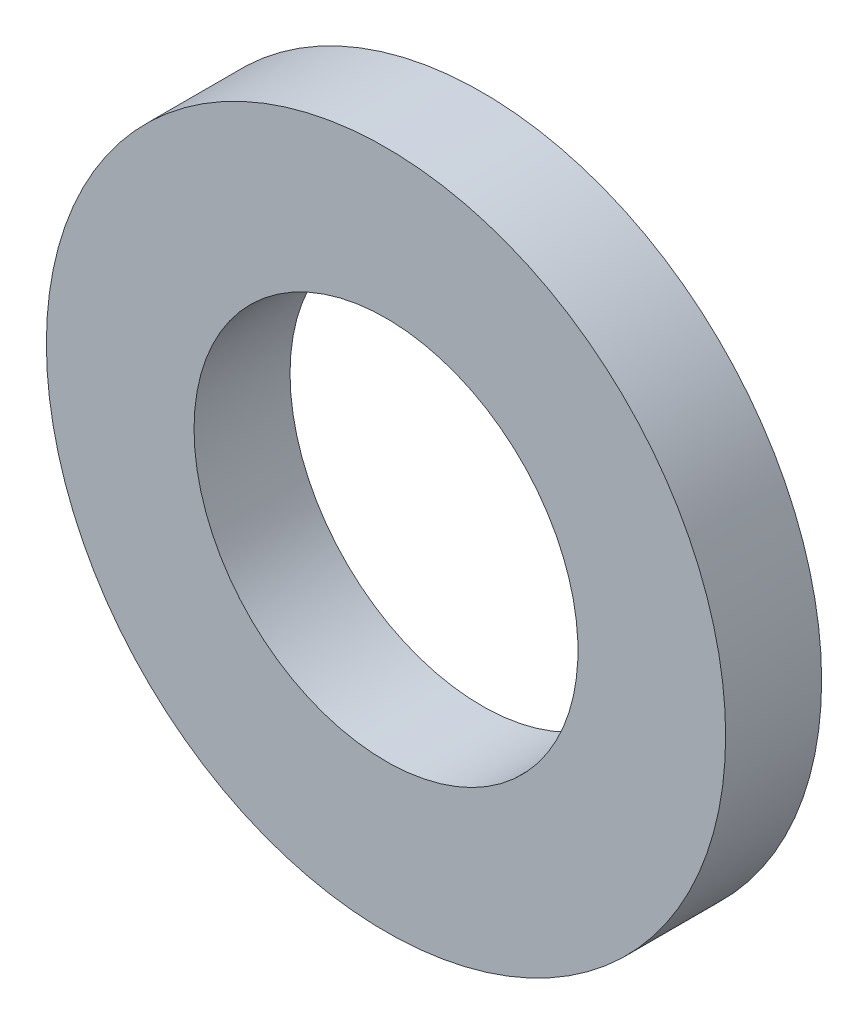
ISO-10303-21;
HEADER;
FILE_DESCRIPTION(('STEP AP214'),'2;1');
FILE_NAME('part.step','',(''),(''),'','','');
FILE_SCHEMA(('AUTOMOTIVE_DESIGN { 1 0 10303 214 1 1 1 1 }'));
ENDSEC;
DATA;
#1=APPLICATION_CONTEXT('core data for automotive mechanical design processes');
#2=APPLICATION_PROTOCOL_DEFINITION('international standard','automotive_design',2000,#1);
#3=PRODUCT_CONTEXT('',#1,'mechanical');
#4=PRODUCT('Part','Part','',(#3));
#5=PRODUCT_RELATED_PRODUCT_CATEGORY('part','',(#4));
#6=PRODUCT_DEFINITION_FORMATION('','',#4);
#7=PRODUCT_DEFINITION_CONTEXT('part definition',#1,'design');
#8=PRODUCT_DEFINITION('design','',#6,#7);
#9=PRODUCT_DEFINITION_SHAPE('','',#8);
#10=(LENGTH_UNIT() NAMED_UNIT(*) SI_UNIT(.MILLI.,.METRE.));
#11=(NAMED_UNIT(*) PLANE_ANGLE_UNIT() SI_UNIT($,.RADIAN.));
#12=(NAMED_UNIT(*) SI_UNIT($,.STERADIAN.) SOLID_ANGLE_UNIT());
#13=UNCERTAINTY_MEASURE_WITH_UNIT(LENGTH_MEASURE(1.E-05),#10,'distance_accuracy_value','');
#14=(GEOMETRIC_REPRESENTATION_CONTEXT(3) GLOBAL_UNCERTAINTY_ASSIGNED_CONTEXT((#13)) GLOBAL_UNIT_ASSIGNED_CONTEXT((#10,
#11,#12)) REPRESENTATION_CONTEXT('',''));
#15=CARTESIAN_POINT('',(0.,0.,0.));
#16=DIRECTION('',(0.,0.,1.));
#17=DIRECTION('',(1.,0.,0.));
#18=AXIS2_PLACEMENT_3D('',#15,#16,#17);
#19=CARTESIAN_POINT('',(0.,0.,1.651));
#20=DIRECTION('',(0.,0.,1.));
#21=DIRECTION('',(1.,0.,0.));
#22=AXIS2_PLACEMENT_3D('',#19,#20,#21);
#23=PLANE('',#22);
#24=CARTESIAN_POINT('',(0.,0.,1.651));
#25=DIRECTION('',(0.,0.,1.));
#26=DIRECTION('',(1.,0.,0.));
#27=AXIS2_PLACEMENT_3D('',#24,#25,#26);
#28=CIRCLE('',#27,5.842);
#29=CARTESIAN_POINT('',(-5.842,0.,1.651));
#30=VERTEX_POINT('',#29);
#31=EDGE_CURVE('E10',#30,#30,#28,.T.);
#32=ORIENTED_EDGE('',*,*,#31,.T.);
#33=EDGE_LOOP('',(#32));
#34=FACE_BOUND('',#33,.T.);
#35=CARTESIAN_POINT('',(0.,0.,1.651));
#36=DIRECTION('',(0.,0.,1.));
#37=DIRECTION('',(1.,0.,0.));
#38=AXIS2_PLACEMENT_3D('',#35,#36,#37);
#39=CIRCLE('',#38,3.302);
#40=CARTESIAN_POINT('',(-3.302,0.,1.651));
#41=VERTEX_POINT('',#40);
#42=EDGE_CURVE('E42',#41,#41,#39,.T.);
#43=ORIENTED_EDGE('',*,*,#42,.F.);
#44=EDGE_LOOP('',(#43));
#45=FACE_BOUND('',#44,.T.);
#46=ADVANCED_FACE('F31',(#34,#45),#23,.T.);
#47=CARTESIAN_POINT('',(0.,0.,0.));
#48=DIRECTION('',(0.,0.,1.));
#49=DIRECTION('',(1.,0.,0.));
#50=AXIS2_PLACEMENT_3D('',#47,#48,#49);
#51=PLANE('',#50);
#52=CARTESIAN_POINT('',(0.,0.,0.));
#53=DIRECTION('',(0.,0.,1.));
#54=DIRECTION('',(1.,0.,0.));
#55=AXIS2_PLACEMENT_3D('',#52,#53,#54);
#56=CIRCLE('',#55,5.842);
#57=CARTESIAN_POINT('',(-5.842,0.,0.));
#58=VERTEX_POINT('',#57);
#59=EDGE_CURVE('E35',#58,#58,#56,.T.);
#60=ORIENTED_EDGE('',*,*,#59,.F.);
#61=EDGE_LOOP('',(#60));
#62=FACE_BOUND('',#61,.T.);
#63=CARTESIAN_POINT('',(0.,0.,0.));
#64=DIRECTION('',(0.,0.,1.));
#65=DIRECTION('',(1.,0.,0.));
#66=AXIS2_PLACEMENT_3D('',#63,#64,#65);
#67=CIRCLE('',#66,3.302);
#68=CARTESIAN_POINT('',(-3.302,0.,0.));
#69=VERTEX_POINT('',#68);
#70=EDGE_CURVE('E44',#69,#69,#67,.T.);
#71=ORIENTED_EDGE('',*,*,#70,.T.);
#72=EDGE_LOOP('',(#71));
#73=FACE_BOUND('',#72,.T.);
#74=ADVANCED_FACE('F54',(#62,#73),#51,.F.);
#75=CARTESIAN_POINT('',(0.,0.,1.651));
#76=DIRECTION('',(0.,0.,-1.));
#77=DIRECTION('',(-1.,0.,0.));
#78=AXIS2_PLACEMENT_3D('',#75,#76,#77);
#79=CYLINDRICAL_SURFACE('',#78,5.842);
#80=CARTESIAN_POINT('',(-5.842,0.,1.651));
#81=CARTESIAN_POINT('',(-5.842,0.,1.63380208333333));
#82=CARTESIAN_POINT('',(-5.842,0.,1.61660416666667));
#83=CARTESIAN_POINT('',(-5.842,0.,1.58220833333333));
#84=CARTESIAN_POINT('',(-5.842,0.,1.56501041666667));
#85=CARTESIAN_POINT('',(-5.842,0.,1.53061458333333));
#86=CARTESIAN_POINT('',(-5.842,0.,1.51341666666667));
#87=CARTESIAN_POINT('',(-5.842,0.,1.47902083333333));
#88=CARTESIAN_POINT('',(-5.842,0.,1.46182291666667));
#89=CARTESIAN_POINT('',(-5.842,0.,1.42742708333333));
#90=CARTESIAN_POINT('',(-5.842,0.,1.41022916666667));
#91=CARTESIAN_POINT('',(-5.842,0.,1.37583333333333));
#92=CARTESIAN_POINT('',(-5.842,0.,1.35863541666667));
#93=CARTESIAN_POINT('',(-5.842,0.,1.32423958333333));
#94=CARTESIAN_POINT('',(-5.842,0.,1.30704166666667));
#95=CARTESIAN_POINT('',(-5.842,0.,1.27264583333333));
#96=CARTESIAN_POINT('',(-5.842,0.,1.25544791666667));
#97=CARTESIAN_POINT('',(-5.842,0.,1.22105208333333));
#98=CARTESIAN_POINT('',(-5.842,0.,1.20385416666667));
#99=CARTESIAN_POINT('',(-5.842,0.,1.16945833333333));
#100=CARTESIAN_POINT('',(-5.842,0.,1.15226041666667));
#101=CARTESIAN_POINT('',(-5.842,0.,1.11786458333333));
#102=CARTESIAN_POINT('',(-5.842,0.,1.10066666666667));
#103=CARTESIAN_POINT('',(-5.842,0.,1.06627083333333));
#104=CARTESIAN_POINT('',(-5.842,0.,1.04907291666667));
#105=CARTESIAN_POINT('',(-5.842,0.,1.01467708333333));
#106=CARTESIAN_POINT('',(-5.842,0.,0.997479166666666));
#107=CARTESIAN_POINT('',(-5.842,0.,0.963083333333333));
#108=CARTESIAN_POINT('',(-5.842,0.,0.945885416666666));
#109=CARTESIAN_POINT('',(-5.842,0.,0.911489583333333));
#110=CARTESIAN_POINT('',(-5.842,0.,0.894291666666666));
#111=CARTESIAN_POINT('',(-5.842,0.,0.859895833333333));
#112=CARTESIAN_POINT('',(-5.842,0.,0.842697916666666));
#113=CARTESIAN_POINT('',(-5.842,0.,0.808302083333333));
#114=CARTESIAN_POINT('',(-5.842,0.,0.791104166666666));
#115=CARTESIAN_POINT('',(-5.842,0.,0.756708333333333));
#116=CARTESIAN_POINT('',(-5.842,0.,0.739510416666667));
#117=CARTESIAN_POINT('',(-5.842,0.,0.705114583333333));
#118=CARTESIAN_POINT('',(-5.842,0.,0.687916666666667));
#119=CARTESIAN_POINT('',(-5.842,0.,0.653520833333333));
#120=CARTESIAN_POINT('',(-5.842,0.,0.636322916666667));
#121=CARTESIAN_POINT('',(-5.842,0.,0.601927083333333));
#122=CARTESIAN_POINT('',(-5.842,0.,0.584729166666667));
#123=CARTESIAN_POINT('',(-5.842,0.,0.550333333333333));
#124=CARTESIAN_POINT('',(-5.842,0.,0.533135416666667));
#125=CARTESIAN_POINT('',(-5.842,0.,0.498739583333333));
#126=CARTESIAN_POINT('',(-5.842,0.,0.481541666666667));
#127=CARTESIAN_POINT('',(-5.842,0.,0.447145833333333));
#128=CARTESIAN_POINT('',(-5.842,0.,0.429947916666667));
#129=CARTESIAN_POINT('',(-5.842,0.,0.395552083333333));
#130=CARTESIAN_POINT('',(-5.842,0.,0.378354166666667));
#131=CARTESIAN_POINT('',(-5.842,0.,0.343958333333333));
#132=CARTESIAN_POINT('',(-5.842,0.,0.326760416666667));
#133=CARTESIAN_POINT('',(-5.842,0.,0.292364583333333));
#134=CARTESIAN_POINT('',(-5.842,0.,0.275166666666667));
#135=CARTESIAN_POINT('',(-5.842,0.,0.240770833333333));
#136=CARTESIAN_POINT('',(-5.842,0.,0.223572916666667));
#137=CARTESIAN_POINT('',(-5.842,0.,0.189177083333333));
#138=CARTESIAN_POINT('',(-5.842,0.,0.171979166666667));
#139=CARTESIAN_POINT('',(-5.842,0.,0.137583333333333));
#140=CARTESIAN_POINT('',(-5.842,0.,0.120385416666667));
#141=CARTESIAN_POINT('',(-5.842,0.,0.0859895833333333));
#142=CARTESIAN_POINT('',(-5.842,0.,0.0687916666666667));
#143=CARTESIAN_POINT('',(-5.842,0.,0.0343958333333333));
#144=CARTESIAN_POINT('',(-5.842,0.,0.0171979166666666));
#145=CARTESIAN_POINT('',(-5.842,0.,0.));
#146=B_SPLINE_CURVE_WITH_KNOTS('',3,(#80,#81,#82,#83,#84,#85,#86,#87,#88,#89,#90,#91,#92,#93,
#94,#95,#96,#97,#98,#99,#100,#101,#102,#103,#104,#105,#106,#107,#108,#109,#110,#111,#112,#113,
#114,#115,#116,#117,#118,#119,#120,#121,#122,#123,#124,#125,#126,#127,#128,#129,#130,#131,#132,
#133,#134,#135,#136,#137,#138,#139,#140,#141,#142,#143,#144,#145),.UNSPECIFIED.,.F.,.F.,(4,2,2,
2,2,2,2,2,2,2,2,2,2,2,2,2,2,2,2,2,2,2,2,2,2,2,2,2,2,2,2,2,4),(0.,0.0515937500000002,0.1031875,
0.15478125,0.206375,0.25796875,0.3095625,0.36115625,0.41275,0.46434375,0.5159375,0.56753125,
0.619125,0.67071875,0.7223125,0.77390625,0.8255,0.87709375,0.9286875,0.98028125,1.031875,
1.08346875,1.1350625,1.18665625,1.23825,1.28984375,1.3414375,1.39303125,1.444625,1.49621875,
1.5478125,1.59940625,1.651),.UNSPECIFIED.);
#147=EDGE_CURVE('BSEAM33',#30,#58,#146,.T.);
#148=ORIENTED_EDGE('',*,*,#31,.F.);
#149=ORIENTED_EDGE('',*,*,#59,.T.);
#150=ORIENTED_EDGE('',*,*,#147,.T.);
#151=ORIENTED_EDGE('',*,*,#147,.F.);
#152=EDGE_LOOP('',(#148,#150,#149,#151));
#153=FACE_BOUND('',#152,.T.);
#154=ADVANCED_FACE('F33',(#153),#79,.T.);
#155=CARTESIAN_POINT('',(0.,0.,1.651));
#156=DIRECTION('',(0.,0.,-1.));
#157=DIRECTION('',(-1.,0.,0.));
#158=AXIS2_PLACEMENT_3D('',#155,#156,#157);
#159=CYLINDRICAL_SURFACE('',#158,3.302);
#160=CARTESIAN_POINT('',(-3.302,0.,1.651));
#161=CARTESIAN_POINT('',(-3.302,0.,1.63380208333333));
#162=CARTESIAN_POINT('',(-3.302,0.,1.61660416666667));
#163=CARTESIAN_POINT('',(-3.302,0.,1.58220833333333));
#164=CARTESIAN_POINT('',(-3.302,0.,1.56501041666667));
#165=CARTESIAN_POINT('',(-3.302,0.,1.53061458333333));
#166=CARTESIAN_POINT('',(-3.302,0.,1.51341666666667));
#167=CARTESIAN_POINT('',(-3.302,0.,1.47902083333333));
#168=CARTESIAN_POINT('',(-3.302,0.,1.46182291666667));
#169=CARTESIAN_POINT('',(-3.302,0.,1.42742708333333));
#170=CARTESIAN_POINT('',(-3.302,0.,1.41022916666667));
#171=CARTESIAN_POINT('',(-3.302,0.,1.37583333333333));
#172=CARTESIAN_POINT('',(-3.302,0.,1.35863541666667));
#173=CARTESIAN_POINT('',(-3.302,0.,1.32423958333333));
#174=CARTESIAN_POINT('',(-3.302,0.,1.30704166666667));
#175=CARTESIAN_POINT('',(-3.302,0.,1.27264583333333));
#176=CARTESIAN_POINT('',(-3.302,0.,1.25544791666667));
#177=CARTESIAN_POINT('',(-3.302,0.,1.22105208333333));
#178=CARTESIAN_POINT('',(-3.302,0.,1.20385416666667));
#179=CARTESIAN_POINT('',(-3.302,0.,1.16945833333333));
#180=CARTESIAN_POINT('',(-3.302,0.,1.15226041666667));
#181=CARTESIAN_POINT('',(-3.302,0.,1.11786458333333));
#182=CARTESIAN_POINT('',(-3.302,0.,1.10066666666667));
#183=CARTESIAN_POINT('',(-3.302,0.,1.06627083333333));
#184=CARTESIAN_POINT('',(-3.302,0.,1.04907291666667));
#185=CARTESIAN_POINT('',(-3.302,0.,1.01467708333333));
#186=CARTESIAN_POINT('',(-3.302,0.,0.997479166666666));
#187=CARTESIAN_POINT('',(-3.302,0.,0.963083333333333));
#188=CARTESIAN_POINT('',(-3.302,0.,0.945885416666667));
#189=CARTESIAN_POINT('',(-3.302,0.,0.911489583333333));
#190=CARTESIAN_POINT('',(-3.302,0.,0.894291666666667));
#191=CARTESIAN_POINT('',(-3.302,0.,0.859895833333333));
#192=CARTESIAN_POINT('',(-3.302,0.,0.842697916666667));
#193=CARTESIAN_POINT('',(-3.302,0.,0.808302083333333));
#194=CARTESIAN_POINT('',(-3.302,0.,0.791104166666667));
#195=CARTESIAN_POINT('',(-3.302,0.,0.756708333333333));
#196=CARTESIAN_POINT('',(-3.302,0.,0.739510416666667));
#197=CARTESIAN_POINT('',(-3.302,0.,0.705114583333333));
#198=CARTESIAN_POINT('',(-3.302,0.,0.687916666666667));
#199=CARTESIAN_POINT('',(-3.302,0.,0.653520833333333));
#200=CARTESIAN_POINT('',(-3.302,0.,0.636322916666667));
#201=CARTESIAN_POINT('',(-3.302,0.,0.601927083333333));
#202=CARTESIAN_POINT('',(-3.302,0.,0.584729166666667));
#203=CARTESIAN_POINT('',(-3.302,0.,0.550333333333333));
#204=CARTESIAN_POINT('',(-3.302,0.,0.533135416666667));
#205=CARTESIAN_POINT('',(-3.302,0.,0.498739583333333));
#206=CARTESIAN_POINT('',(-3.302,0.,0.481541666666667));
#207=CARTESIAN_POINT('',(-3.302,0.,0.447145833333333));
#208=CARTESIAN_POINT('',(-3.302,0.,0.429947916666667));
#209=CARTESIAN_POINT('',(-3.302,0.,0.395552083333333));
#210=CARTESIAN_POINT('',(-3.302,0.,0.378354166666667));
#211=CARTESIAN_POINT('',(-3.302,0.,0.343958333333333));
#212=CARTESIAN_POINT('',(-3.302,0.,0.326760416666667));
#213=CARTESIAN_POINT('',(-3.302,0.,0.292364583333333));
#214=CARTESIAN_POINT('',(-3.302,0.,0.275166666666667));
#215=CARTESIAN_POINT('',(-3.302,0.,0.240770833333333));
#216=CARTESIAN_POINT('',(-3.302,0.,0.223572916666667));
#217=CARTESIAN_POINT('',(-3.302,0.,0.189177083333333));
#218=CARTESIAN_POINT('',(-3.302,0.,0.171979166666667));
#219=CARTESIAN_POINT('',(-3.302,0.,0.137583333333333));
#220=CARTESIAN_POINT('',(-3.302,0.,0.120385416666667));
#221=CARTESIAN_POINT('',(-3.302,0.,0.0859895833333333));
#222=CARTESIAN_POINT('',(-3.302,0.,0.0687916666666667));
#223=CARTESIAN_POINT('',(-3.302,0.,0.0343958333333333));
#224=CARTESIAN_POINT('',(-3.302,0.,0.0171979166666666));
#225=CARTESIAN_POINT('',(-3.302,0.,0.));
#226=B_SPLINE_CURVE_WITH_KNOTS('',3,(#160,#161,#162,#163,#164,#165,#166,#167,#168,#169,#170,
#171,#172,#173,#174,#175,#176,#177,#178,#179,#180,#181,#182,#183,#184,#185,#186,#187,#188,#189,
#190,#191,#192,#193,#194,#195,#196,#197,#198,#199,#200,#201,#202,#203,#204,#205,#206,#207,#208,
#209,#210,#211,#212,#213,#214,#215,#216,#217,#218,#219,#220,#221,#222,#223,#224,#225),
.UNSPECIFIED.,.F.,.F.,(4,2,2,2,2,2,2,2,2,2,2,2,2,2,2,2,2,2,2,2,2,2,2,2,2,2,2,2,2,2,2,2,4),(0.,
0.05159375,0.1031875,0.15478125,0.206375,0.25796875,0.3095625,0.36115625,0.41275,0.46434375,
0.5159375,0.56753125,0.619125,0.67071875,0.7223125,0.77390625,0.8255,0.87709375,0.9286875,
0.98028125,1.031875,1.08346875,1.1350625,1.18665625,1.23825,1.28984375,1.3414375,1.39303125,
1.444625,1.49621875,1.5478125,1.59940625,1.651),.UNSPECIFIED.);
#227=EDGE_CURVE('BSEAM50',#41,#69,#226,.T.);
#228=ORIENTED_EDGE('',*,*,#42,.T.);
#229=ORIENTED_EDGE('',*,*,#70,.F.);
#230=ORIENTED_EDGE('',*,*,#227,.T.);
#231=ORIENTED_EDGE('',*,*,#227,.F.);
#232=EDGE_LOOP('',(#228,#230,#229,#231));
#233=FACE_BOUND('',#232,.T.);
#234=ADVANCED_FACE('F50',(#233),#159,.F.);
#235=CLOSED_SHELL('',(#46,#74,#154,#234));
#236=MANIFOLD_SOLID_BREP('B2',#235);
#237=ADVANCED_BREP_SHAPE_REPRESENTATION('',(#18,#236),#14);
#238=SHAPE_DEFINITION_REPRESENTATION(#9,#237);
ENDSEC;
END-ISO-10303-21;
